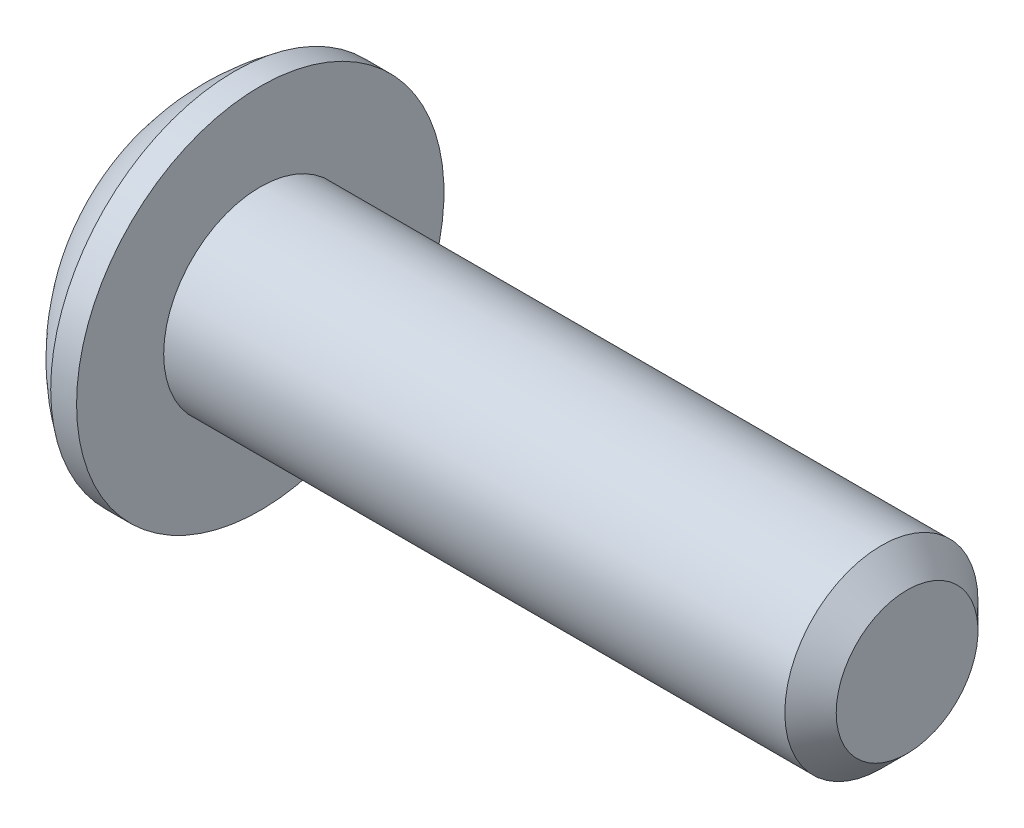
from build123d import *

# Parameters (mm, degrees)
HEX_2_DEPTH = 0.889


with BuildPart() as part:
    # BodySke → BaseBody (revolve)
    with BuildSketch(Plane.XY, mode=Mode.PRIVATE) as basebody_sk:
        with BuildLine():
            Line((11.0236, 0), (11.0236, 1.04394))
            Line((11.0236, 1.04394), (10.64514, 1.4224))
            Line((10.64514, 1.4224), (1.4986, 1.4224))
            Line((1.4986, 1.4224), (1.4986, 2.7051))
            Line((1.4986, 2.7051), (1.1176, 2.7051))
            ThreePointArc((1.1176, 2.7051), (0.467369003, 2.104373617), (0, 1.35255))
            Line((0, 1.35255), (0, 0))
            Line((0, 0), (11.0236, 0))
        make_face()
    revolve(basebody_sk.sketch.rotate(Axis((0, 0, 0), (1, 0, 0)), 90), axis=Axis((0, 0, 0), (1, 0, 0)))

    # Sketch2 → PreBroach (revolve, cut)
    with BuildSketch(Plane.XY, mode=Mode.PRIVATE) as prebroach_sk:
        Polygon((0, 0.7874), (0.889, 0.7874), (1.343605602, 0), (0, 0), align=None)
    revolve(prebroach_sk.sketch.rotate(Axis((0, 0, 0), (1, 0, 0)), 90), axis=Axis((0, 0, 0), (1, 0, 0)), mode=Mode.SUBTRACT)

    # Sketch3 → Hex 2 (cut)
    with BuildSketch(Plane(origin=(0, 0, 0), x_dir=(0, 0, -1), z_dir=(1, 0, 0))):
        Polygon((-0.7874, -0.454605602), (-0.7874, 0.454605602), (0, 0.909211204), (0.7874, 0.454605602), (0.7874, -0.454605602), (0, -0.909211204), align=None)
    extrude(amount=HEX_2_DEPTH, mode=Mode.SUBTRACT)


solid = part.part
